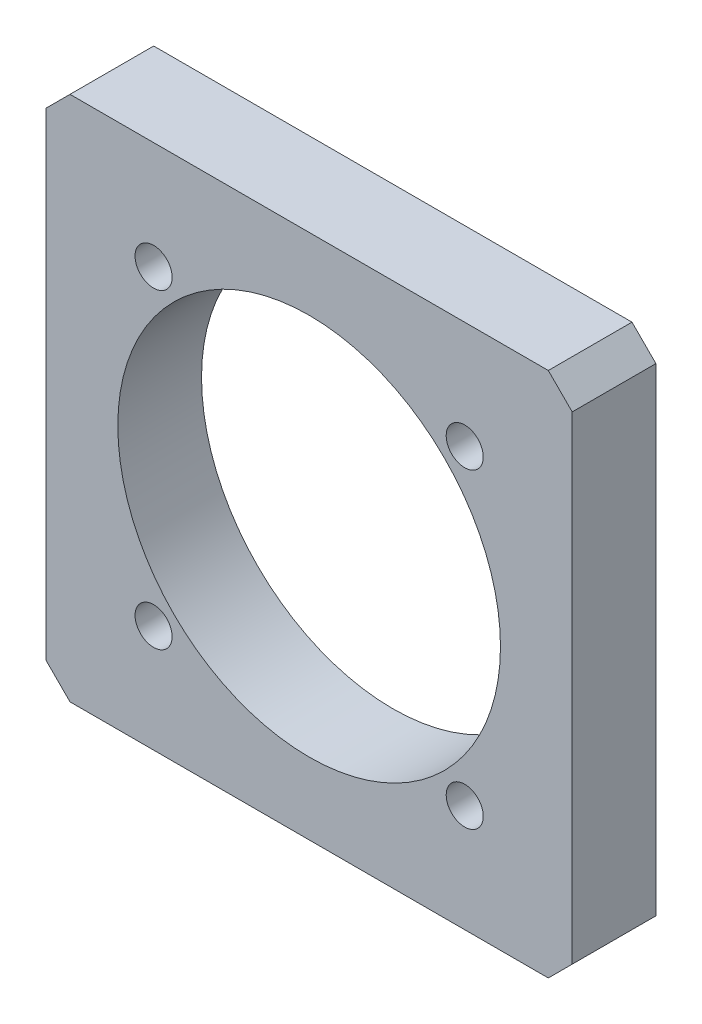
ISO-10303-21;
HEADER;
FILE_DESCRIPTION(('STEP AP214'),'2;1');
FILE_NAME('part.step','',(''),(''),'','','');
FILE_SCHEMA(('AUTOMOTIVE_DESIGN { 1 0 10303 214 1 1 1 1 }'));
ENDSEC;
DATA;
#1=APPLICATION_CONTEXT('core data for automotive mechanical design processes');
#2=APPLICATION_PROTOCOL_DEFINITION('international standard','automotive_design',2000,#1);
#3=PRODUCT_CONTEXT('',#1,'mechanical');
#4=PRODUCT('Part','Part','',(#3));
#5=PRODUCT_RELATED_PRODUCT_CATEGORY('part','',(#4));
#6=PRODUCT_DEFINITION_FORMATION('','',#4);
#7=PRODUCT_DEFINITION_CONTEXT('part definition',#1,'design');
#8=PRODUCT_DEFINITION('design','',#6,#7);
#9=PRODUCT_DEFINITION_SHAPE('','',#8);
#10=(LENGTH_UNIT() NAMED_UNIT(*) SI_UNIT(.MILLI.,.METRE.));
#11=(NAMED_UNIT(*) PLANE_ANGLE_UNIT() SI_UNIT($,.RADIAN.));
#12=(NAMED_UNIT(*) SI_UNIT($,.STERADIAN.) SOLID_ANGLE_UNIT());
#13=UNCERTAINTY_MEASURE_WITH_UNIT(LENGTH_MEASURE(1.E-05),#10,'distance_accuracy_value','');
#14=(GEOMETRIC_REPRESENTATION_CONTEXT(3) GLOBAL_UNCERTAINTY_ASSIGNED_CONTEXT((#13)) GLOBAL_UNIT_ASSIGNED_CONTEXT((#10,
#11,#12)) REPRESENTATION_CONTEXT('',''));
#15=CARTESIAN_POINT('',(0.,0.,0.));
#16=DIRECTION('',(0.,0.,1.));
#17=DIRECTION('',(1.,0.,0.));
#18=AXIS2_PLACEMENT_3D('',#15,#16,#17);
#19=CARTESIAN_POINT('',(-110.,-110.,35.));
#20=DIRECTION('',(0.,0.,1.));
#21=DIRECTION('',(1.,0.,0.));
#22=AXIS2_PLACEMENT_3D('',#19,#20,#21);
#23=PLANE('',#22);
#24=CARTESIAN_POINT('',(-65.0538238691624,65.0538238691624,35.));
#25=DIRECTION('',(0.,0.,-1.));
#26=DIRECTION('',(-1.,0.,0.));
#27=AXIS2_PLACEMENT_3D('',#24,#25,#26);
#28=CIRCLE('',#27,7.74999999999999);
#29=CARTESIAN_POINT('',(-72.8038238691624,65.0538238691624,35.));
#30=VERTEX_POINT('',#29);
#31=EDGE_CURVE('E203',#30,#30,#28,.T.);
#32=ORIENTED_EDGE('',*,*,#31,.T.);
#33=EDGE_LOOP('',(#32));
#34=FACE_BOUND('',#33,.T.);
#35=CARTESIAN_POINT('',(65.0538238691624,65.0538238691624,35.));
#36=DIRECTION('',(0.,0.,-1.));
#37=DIRECTION('',(-1.,0.,0.));
#38=AXIS2_PLACEMENT_3D('',#35,#36,#37);
#39=CIRCLE('',#38,7.74999999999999);
#40=CARTESIAN_POINT('',(57.3038238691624,65.0538238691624,35.));
#41=VERTEX_POINT('',#40);
#42=EDGE_CURVE('E197',#41,#41,#39,.T.);
#43=ORIENTED_EDGE('',*,*,#42,.T.);
#44=EDGE_LOOP('',(#43));
#45=FACE_BOUND('',#44,.T.);
#46=CARTESIAN_POINT('',(65.0538238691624,-65.0538238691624,35.));
#47=DIRECTION('',(0.,0.,-1.));
#48=DIRECTION('',(-1.,0.,0.));
#49=AXIS2_PLACEMENT_3D('',#46,#47,#48);
#50=CIRCLE('',#49,7.74999999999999);
#51=CARTESIAN_POINT('',(57.3038238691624,-65.0538238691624,35.));
#52=VERTEX_POINT('',#51);
#53=EDGE_CURVE('E191',#52,#52,#50,.T.);
#54=ORIENTED_EDGE('',*,*,#53,.T.);
#55=EDGE_LOOP('',(#54));
#56=FACE_BOUND('',#55,.T.);
#57=CARTESIAN_POINT('',(-65.0538238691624,-65.0538238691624,35.));
#58=DIRECTION('',(0.,0.,-1.));
#59=DIRECTION('',(-1.,0.,0.));
#60=AXIS2_PLACEMENT_3D('',#57,#58,#59);
#61=CIRCLE('',#60,7.74999999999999);
#62=CARTESIAN_POINT('',(-72.8038238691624,-65.0538238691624,35.));
#63=VERTEX_POINT('',#62);
#64=EDGE_CURVE('E183',#63,#63,#61,.T.);
#65=ORIENTED_EDGE('',*,*,#64,.T.);
#66=EDGE_LOOP('',(#65));
#67=FACE_BOUND('',#66,.T.);
#68=DIRECTION('',(0.,-1.,0.));
#69=VECTOR('',#68,1.);
#70=CARTESIAN_POINT('',(-110.,110.,35.));
#71=LINE('',#70,#69);
#72=CARTESIAN_POINT('',(-110.,99.9999999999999,35.));
#73=VERTEX_POINT('',#72);
#74=CARTESIAN_POINT('',(-110.,-99.9999999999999,35.));
#75=VERTEX_POINT('',#74);
#76=EDGE_CURVE('E137',#73,#75,#71,.T.);
#77=ORIENTED_EDGE('',*,*,#76,.T.);
#78=DIRECTION('',(-0.707106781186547,0.707106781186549,0.));
#79=VECTOR('',#78,1.);
#80=CARTESIAN_POINT('',(-105.,-105.,35.));
#81=LINE('',#80,#79);
#82=CARTESIAN_POINT('',(-99.9999999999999,-110.,35.));
#83=VERTEX_POINT('',#82);
#84=EDGE_CURVE('E151',#75,#83,#81,.F.);
#85=ORIENTED_EDGE('',*,*,#84,.T.);
#86=DIRECTION('',(1.,0.,0.));
#87=VECTOR('',#86,1.);
#88=CARTESIAN_POINT('',(-110.,-110.,35.));
#89=LINE('',#88,#87);
#90=CARTESIAN_POINT('',(100.,-110.,35.));
#91=VERTEX_POINT('',#90);
#92=EDGE_CURVE('E118',#83,#91,#89,.T.);
#93=ORIENTED_EDGE('',*,*,#92,.T.);
#94=DIRECTION('',(-0.707106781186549,-0.707106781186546,0.));
#95=VECTOR('',#94,1.);
#96=CARTESIAN_POINT('',(-5.00000000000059,-215.,35.));
#97=LINE('',#96,#95);
#98=CARTESIAN_POINT('',(110.,-100.,35.));
#99=VERTEX_POINT('',#98);
#100=EDGE_CURVE('E147',#91,#99,#97,.F.);
#101=ORIENTED_EDGE('',*,*,#100,.T.);
#102=DIRECTION('',(0.,1.,0.));
#103=VECTOR('',#102,1.);
#104=CARTESIAN_POINT('',(110.,110.,35.));
#105=LINE('',#104,#103);
#106=CARTESIAN_POINT('',(110.,100.,35.));
#107=VERTEX_POINT('',#106);
#108=EDGE_CURVE('E160',#99,#107,#105,.T.);
#109=ORIENTED_EDGE('',*,*,#108,.T.);
#110=DIRECTION('',(0.707106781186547,-0.707106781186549,0.));
#111=VECTOR('',#110,1.);
#112=CARTESIAN_POINT('',(105.,105.,35.));
#113=LINE('',#112,#111);
#114=CARTESIAN_POINT('',(99.9999999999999,110.,35.));
#115=VERTEX_POINT('',#114);
#116=EDGE_CURVE('E53',#107,#115,#113,.F.);
#117=ORIENTED_EDGE('',*,*,#116,.T.);
#118=DIRECTION('',(-1.,0.,0.));
#119=VECTOR('',#118,1.);
#120=CARTESIAN_POINT('',(-110.,110.,35.));
#121=LINE('',#120,#119);
#122=CARTESIAN_POINT('',(-99.9999999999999,110.,35.));
#123=VERTEX_POINT('',#122);
#124=EDGE_CURVE('E138',#115,#123,#121,.T.);
#125=ORIENTED_EDGE('',*,*,#124,.T.);
#126=DIRECTION('',(0.707106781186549,0.707106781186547,0.));
#127=VECTOR('',#126,1.);
#128=CARTESIAN_POINT('',(-215.,-4.99999999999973,35.));
#129=LINE('',#128,#127);
#130=EDGE_CURVE('E149',#123,#73,#129,.F.);
#131=ORIENTED_EDGE('',*,*,#130,.T.);
#132=EDGE_LOOP('',(#77,#85,#93,#101,#109,#117,#125,#131));
#133=FACE_BOUND('',#132,.T.);
#134=CARTESIAN_POINT('',(0.,0.,35.));
#135=DIRECTION('',(0.,0.,1.));
#136=DIRECTION('',(1.,0.,0.));
#137=AXIS2_PLACEMENT_3D('',#134,#135,#136);
#138=CIRCLE('',#137,80.);
#139=CARTESIAN_POINT('',(80.,0.,35.));
#140=VERTEX_POINT('',#139);
#141=EDGE_CURVE('E132',#140,#140,#138,.T.);
#142=ORIENTED_EDGE('',*,*,#141,.F.);
#143=EDGE_LOOP('',(#142));
#144=FACE_BOUND('',#143,.T.);
#145=ADVANCED_FACE('F31',(#34,#45,#56,#67,#133,#144),#23,.T.);
#146=CARTESIAN_POINT('',(-110.,-110.,0.));
#147=DIRECTION('',(0.,0.,1.));
#148=DIRECTION('',(1.,0.,0.));
#149=AXIS2_PLACEMENT_3D('',#146,#147,#148);
#150=PLANE('',#149);
#151=CARTESIAN_POINT('',(-65.0538238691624,65.0538238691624,0.));
#152=DIRECTION('',(0.,0.,-1.));
#153=DIRECTION('',(-1.,0.,0.));
#154=AXIS2_PLACEMENT_3D('',#151,#152,#153);
#155=CIRCLE('',#154,7.74999999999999);
#156=CARTESIAN_POINT('',(-72.8038238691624,65.0538238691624,0.));
#157=VERTEX_POINT('',#156);
#158=EDGE_CURVE('E206',#157,#157,#155,.T.);
#159=ORIENTED_EDGE('',*,*,#158,.F.);
#160=EDGE_LOOP('',(#159));
#161=FACE_BOUND('',#160,.T.);
#162=CARTESIAN_POINT('',(65.0538238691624,65.0538238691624,0.));
#163=DIRECTION('',(0.,0.,-1.));
#164=DIRECTION('',(-1.,0.,0.));
#165=AXIS2_PLACEMENT_3D('',#162,#163,#164);
#166=CIRCLE('',#165,7.74999999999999);
#167=CARTESIAN_POINT('',(57.3038238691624,65.0538238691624,0.));
#168=VERTEX_POINT('',#167);
#169=EDGE_CURVE('E200',#168,#168,#166,.T.);
#170=ORIENTED_EDGE('',*,*,#169,.F.);
#171=EDGE_LOOP('',(#170));
#172=FACE_BOUND('',#171,.T.);
#173=CARTESIAN_POINT('',(65.0538238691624,-65.0538238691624,0.));
#174=DIRECTION('',(0.,0.,-1.));
#175=DIRECTION('',(-1.,0.,0.));
#176=AXIS2_PLACEMENT_3D('',#173,#174,#175);
#177=CIRCLE('',#176,7.74999999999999);
#178=CARTESIAN_POINT('',(57.3038238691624,-65.0538238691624,0.));
#179=VERTEX_POINT('',#178);
#180=EDGE_CURVE('E194',#179,#179,#177,.T.);
#181=ORIENTED_EDGE('',*,*,#180,.F.);
#182=EDGE_LOOP('',(#181));
#183=FACE_BOUND('',#182,.T.);
#184=CARTESIAN_POINT('',(-65.0538238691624,-65.0538238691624,0.));
#185=DIRECTION('',(0.,0.,-1.));
#186=DIRECTION('',(-1.,0.,0.));
#187=AXIS2_PLACEMENT_3D('',#184,#185,#186);
#188=CIRCLE('',#187,7.74999999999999);
#189=CARTESIAN_POINT('',(-72.8038238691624,-65.0538238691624,0.));
#190=VERTEX_POINT('',#189);
#191=EDGE_CURVE('E188',#190,#190,#188,.T.);
#192=ORIENTED_EDGE('',*,*,#191,.F.);
#193=EDGE_LOOP('',(#192));
#194=FACE_BOUND('',#193,.T.);
#195=DIRECTION('',(1.,0.,0.));
#196=VECTOR('',#195,1.);
#197=CARTESIAN_POINT('',(-110.,-110.,0.));
#198=LINE('',#197,#196);
#199=CARTESIAN_POINT('',(-99.9999999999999,-110.,0.));
#200=VERTEX_POINT('',#199);
#201=CARTESIAN_POINT('',(99.9999999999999,-110.,0.));
#202=VERTEX_POINT('',#201);
#203=EDGE_CURVE('E115',#200,#202,#198,.T.);
#204=ORIENTED_EDGE('',*,*,#203,.F.);
#205=DIRECTION('',(0.707106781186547,-0.707106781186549,0.));
#206=VECTOR('',#205,1.);
#207=CARTESIAN_POINT('',(-99.9999999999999,-110.,0.));
#208=LINE('',#207,#206);
#209=CARTESIAN_POINT('',(-110.,-99.9999999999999,0.));
#210=VERTEX_POINT('',#209);
#211=EDGE_CURVE('E98',#200,#210,#208,.F.);
#212=ORIENTED_EDGE('',*,*,#211,.T.);
#213=DIRECTION('',(0.,-1.,0.));
#214=VECTOR('',#213,1.);
#215=CARTESIAN_POINT('',(-110.,110.,0.));
#216=LINE('',#215,#214);
#217=CARTESIAN_POINT('',(-110.,100.,0.));
#218=VERTEX_POINT('',#217);
#219=EDGE_CURVE('E127',#218,#210,#216,.T.);
#220=ORIENTED_EDGE('',*,*,#219,.F.);
#221=DIRECTION('',(-0.707106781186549,-0.707106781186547,0.));
#222=VECTOR('',#221,1.);
#223=CARTESIAN_POINT('',(-110.,100.,0.));
#224=LINE('',#223,#222);
#225=CARTESIAN_POINT('',(-99.9999999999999,110.,0.));
#226=VERTEX_POINT('',#225);
#227=EDGE_CURVE('E109',#218,#226,#224,.F.);
#228=ORIENTED_EDGE('',*,*,#227,.T.);
#229=DIRECTION('',(-1.,0.,0.));
#230=VECTOR('',#229,1.);
#231=CARTESIAN_POINT('',(-110.,110.,0.));
#232=LINE('',#231,#230);
#233=CARTESIAN_POINT('',(100.,110.,0.));
#234=VERTEX_POINT('',#233);
#235=EDGE_CURVE('E130',#234,#226,#232,.T.);
#236=ORIENTED_EDGE('',*,*,#235,.F.);
#237=DIRECTION('',(-0.707106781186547,0.707106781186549,0.));
#238=VECTOR('',#237,1.);
#239=CARTESIAN_POINT('',(100.,110.,0.));
#240=LINE('',#239,#238);
#241=CARTESIAN_POINT('',(110.,100.,0.));
#242=VERTEX_POINT('',#241);
#243=EDGE_CURVE('E119',#234,#242,#240,.F.);
#244=ORIENTED_EDGE('',*,*,#243,.T.);
#245=DIRECTION('',(0.,1.,0.));
#246=VECTOR('',#245,1.);
#247=CARTESIAN_POINT('',(110.,110.,0.));
#248=LINE('',#247,#246);
#249=CARTESIAN_POINT('',(110.,-100.,0.));
#250=VERTEX_POINT('',#249);
#251=EDGE_CURVE('E126',#250,#242,#248,.T.);
#252=ORIENTED_EDGE('',*,*,#251,.F.);
#253=DIRECTION('',(0.707106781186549,0.707106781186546,0.));
#254=VECTOR('',#253,1.);
#255=CARTESIAN_POINT('',(110.,-100.,0.));
#256=LINE('',#255,#254);
#257=EDGE_CURVE('E125',#250,#202,#256,.F.);
#258=ORIENTED_EDGE('',*,*,#257,.T.);
#259=EDGE_LOOP('',(#204,#212,#220,#228,#236,#244,#252,#258));
#260=FACE_BOUND('',#259,.T.);
#261=CARTESIAN_POINT('',(0.,0.,0.));
#262=DIRECTION('',(0.,0.,1.));
#263=DIRECTION('',(1.,0.,0.));
#264=AXIS2_PLACEMENT_3D('',#261,#262,#263);
#265=CIRCLE('',#264,80.);
#266=CARTESIAN_POINT('',(80.,0.,0.));
#267=VERTEX_POINT('',#266);
#268=EDGE_CURVE('E180',#267,#267,#265,.T.);
#269=ORIENTED_EDGE('',*,*,#268,.T.);
#270=EDGE_LOOP('',(#269));
#271=FACE_BOUND('',#270,.T.);
#272=ADVANCED_FACE('F122',(#161,#172,#183,#194,#260,#271),#150,.F.);
#273=CARTESIAN_POINT('',(-110.,110.,35.));
#274=DIRECTION('',(1.,0.,0.));
#275=DIRECTION('',(0.,1.,0.));
#276=AXIS2_PLACEMENT_3D('',#273,#274,#275);
#277=PLANE('',#276);
#278=ORIENTED_EDGE('',*,*,#219,.T.);
#279=DIRECTION('',(0.,0.,1.));
#280=VECTOR('',#279,1.);
#281=CARTESIAN_POINT('',(-110.,-99.9999999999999,35.));
#282=LINE('',#281,#280);
#283=EDGE_CURVE('E103',#210,#75,#282,.T.);
#284=ORIENTED_EDGE('',*,*,#283,.T.);
#285=ORIENTED_EDGE('',*,*,#76,.F.);
#286=DIRECTION('',(0.,0.,-1.));
#287=VECTOR('',#286,1.);
#288=CARTESIAN_POINT('',(-110.,100.,35.));
#289=LINE('',#288,#287);
#290=EDGE_CURVE('E108',#73,#218,#289,.T.);
#291=ORIENTED_EDGE('',*,*,#290,.T.);
#292=EDGE_LOOP('',(#278,#284,#285,#291));
#293=FACE_BOUND('',#292,.T.);
#294=ADVANCED_FACE('F176',(#293),#277,.F.);
#295=CARTESIAN_POINT('',(-110.,-110.,35.));
#296=DIRECTION('',(0.,1.,0.));
#297=DIRECTION('',(0.,0.,1.));
#298=AXIS2_PLACEMENT_3D('',#295,#296,#297);
#299=PLANE('',#298);
#300=ORIENTED_EDGE('',*,*,#92,.F.);
#301=DIRECTION('',(0.,0.,-1.));
#302=VECTOR('',#301,1.);
#303=CARTESIAN_POINT('',(-99.9999999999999,-110.,35.));
#304=LINE('',#303,#302);
#305=EDGE_CURVE('E102',#83,#200,#304,.T.);
#306=ORIENTED_EDGE('',*,*,#305,.T.);
#307=ORIENTED_EDGE('',*,*,#203,.T.);
#308=DIRECTION('',(0.,0.,1.));
#309=VECTOR('',#308,1.);
#310=CARTESIAN_POINT('',(99.9999999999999,-110.,35.));
#311=LINE('',#310,#309);
#312=EDGE_CURVE('E120',#202,#91,#311,.T.);
#313=ORIENTED_EDGE('',*,*,#312,.T.);
#314=EDGE_LOOP('',(#300,#306,#307,#313));
#315=FACE_BOUND('',#314,.T.);
#316=ADVANCED_FACE('F114',(#315),#299,.F.);
#317=CARTESIAN_POINT('',(110.,110.,35.));
#318=DIRECTION('',(-1.,0.,0.));
#319=DIRECTION('',(0.,-1.,0.));
#320=AXIS2_PLACEMENT_3D('',#317,#318,#319);
#321=PLANE('',#320);
#322=ORIENTED_EDGE('',*,*,#108,.F.);
#323=DIRECTION('',(0.,0.,-1.));
#324=VECTOR('',#323,1.);
#325=CARTESIAN_POINT('',(110.,-100.,35.));
#326=LINE('',#325,#324);
#327=EDGE_CURVE('E11',#99,#250,#326,.T.);
#328=ORIENTED_EDGE('',*,*,#327,.T.);
#329=ORIENTED_EDGE('',*,*,#251,.T.);
#330=DIRECTION('',(0.,0.,1.));
#331=VECTOR('',#330,1.);
#332=CARTESIAN_POINT('',(110.,100.,35.));
#333=LINE('',#332,#331);
#334=EDGE_CURVE('E39',#242,#107,#333,.T.);
#335=ORIENTED_EDGE('',*,*,#334,.T.);
#336=EDGE_LOOP('',(#322,#328,#329,#335));
#337=FACE_BOUND('',#336,.T.);
#338=ADVANCED_FACE('F159',(#337),#321,.F.);
#339=CARTESIAN_POINT('',(-110.,110.,35.));
#340=DIRECTION('',(0.,-1.,0.));
#341=DIRECTION('',(0.,0.,-1.));
#342=AXIS2_PLACEMENT_3D('',#339,#340,#341);
#343=PLANE('',#342);
#344=ORIENTED_EDGE('',*,*,#235,.T.);
#345=DIRECTION('',(0.,0.,1.));
#346=VECTOR('',#345,1.);
#347=CARTESIAN_POINT('',(-99.9999999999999,110.,35.));
#348=LINE('',#347,#346);
#349=EDGE_CURVE('E46',#226,#123,#348,.T.);
#350=ORIENTED_EDGE('',*,*,#349,.T.);
#351=ORIENTED_EDGE('',*,*,#124,.F.);
#352=DIRECTION('',(0.,0.,-1.));
#353=VECTOR('',#352,1.);
#354=CARTESIAN_POINT('',(100.,110.,35.));
#355=LINE('',#354,#353);
#356=EDGE_CURVE('E153',#115,#234,#355,.T.);
#357=ORIENTED_EDGE('',*,*,#356,.T.);
#358=EDGE_LOOP('',(#344,#350,#351,#357));
#359=FACE_BOUND('',#358,.T.);
#360=ADVANCED_FACE('F169',(#359),#343,.F.);
#361=CARTESIAN_POINT('',(0.,0.,35.));
#362=DIRECTION('',(0.,0.,-1.));
#363=DIRECTION('',(-1.,0.,0.));
#364=AXIS2_PLACEMENT_3D('',#361,#362,#363);
#365=CYLINDRICAL_SURFACE('',#364,80.);
#366=ORIENTED_EDGE('',*,*,#141,.T.);
#367=EDGE_LOOP('',(#366));
#368=FACE_BOUND('',#367,.T.);
#369=ORIENTED_EDGE('',*,*,#268,.F.);
#370=EDGE_LOOP('',(#369));
#371=FACE_BOUND('',#370,.T.);
#372=ADVANCED_FACE('F224',(#368,#371),#365,.F.);
#373=CARTESIAN_POINT('',(-65.0538238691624,-65.0538238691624,0.));
#374=DIRECTION('',(0.,0.,-1.));
#375=DIRECTION('',(-1.,0.,0.));
#376=AXIS2_PLACEMENT_3D('',#373,#374,#375);
#377=CYLINDRICAL_SURFACE('',#376,7.74999999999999);
#378=ORIENTED_EDGE('',*,*,#64,.F.);
#379=EDGE_LOOP('',(#378));
#380=FACE_BOUND('',#379,.T.);
#381=ORIENTED_EDGE('',*,*,#191,.T.);
#382=EDGE_LOOP('',(#381));
#383=FACE_BOUND('',#382,.T.);
#384=ADVANCED_FACE('F221',(#380,#383),#377,.F.);
#385=CARTESIAN_POINT('',(65.0538238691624,-65.0538238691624,0.));
#386=DIRECTION('',(0.,0.,-1.));
#387=DIRECTION('',(-1.,0.,0.));
#388=AXIS2_PLACEMENT_3D('',#385,#386,#387);
#389=CYLINDRICAL_SURFACE('',#388,7.74999999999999);
#390=ORIENTED_EDGE('',*,*,#53,.F.);
#391=EDGE_LOOP('',(#390));
#392=FACE_BOUND('',#391,.T.);
#393=ORIENTED_EDGE('',*,*,#180,.T.);
#394=EDGE_LOOP('',(#393));
#395=FACE_BOUND('',#394,.T.);
#396=ADVANCED_FACE('F223',(#392,#395),#389,.F.);
#397=CARTESIAN_POINT('',(65.0538238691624,65.0538238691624,0.));
#398=DIRECTION('',(0.,0.,-1.));
#399=DIRECTION('',(-1.,0.,0.));
#400=AXIS2_PLACEMENT_3D('',#397,#398,#399);
#401=CYLINDRICAL_SURFACE('',#400,7.74999999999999);
#402=ORIENTED_EDGE('',*,*,#42,.F.);
#403=EDGE_LOOP('',(#402));
#404=FACE_BOUND('',#403,.T.);
#405=ORIENTED_EDGE('',*,*,#169,.T.);
#406=EDGE_LOOP('',(#405));
#407=FACE_BOUND('',#406,.T.);
#408=ADVANCED_FACE('F231',(#404,#407),#401,.F.);
#409=CARTESIAN_POINT('',(-65.0538238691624,65.0538238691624,0.));
#410=DIRECTION('',(0.,0.,-1.));
#411=DIRECTION('',(-1.,0.,0.));
#412=AXIS2_PLACEMENT_3D('',#409,#410,#411);
#413=CYLINDRICAL_SURFACE('',#412,7.74999999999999);
#414=ORIENTED_EDGE('',*,*,#31,.F.);
#415=EDGE_LOOP('',(#414));
#416=FACE_BOUND('',#415,.T.);
#417=ORIENTED_EDGE('',*,*,#158,.T.);
#418=EDGE_LOOP('',(#417));
#419=FACE_BOUND('',#418,.T.);
#420=ADVANCED_FACE('F210',(#416,#419),#413,.F.);
#421=CARTESIAN_POINT('',(-99.9999999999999,-110.,35.));
#422=DIRECTION('',(0.707106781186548,0.707106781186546,0.));
#423=DIRECTION('',(-0.707106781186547,0.707106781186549,0.));
#424=AXIS2_PLACEMENT_3D('',#421,#422,#423);
#425=PLANE('',#424);
#426=ORIENTED_EDGE('',*,*,#84,.F.);
#427=ORIENTED_EDGE('',*,*,#283,.F.);
#428=ORIENTED_EDGE('',*,*,#211,.F.);
#429=ORIENTED_EDGE('',*,*,#305,.F.);
#430=EDGE_LOOP('',(#426,#427,#428,#429));
#431=FACE_BOUND('',#430,.T.);
#432=ADVANCED_FACE('F101',(#431),#425,.F.);
#433=CARTESIAN_POINT('',(-110.,100.,35.));
#434=DIRECTION('',(0.707106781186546,-0.707106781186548,0.));
#435=DIRECTION('',(0.707106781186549,0.707106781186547,0.));
#436=AXIS2_PLACEMENT_3D('',#433,#434,#435);
#437=PLANE('',#436);
#438=ORIENTED_EDGE('',*,*,#130,.F.);
#439=ORIENTED_EDGE('',*,*,#349,.F.);
#440=ORIENTED_EDGE('',*,*,#227,.F.);
#441=ORIENTED_EDGE('',*,*,#290,.F.);
#442=EDGE_LOOP('',(#438,#439,#440,#441));
#443=FACE_BOUND('',#442,.T.);
#444=ADVANCED_FACE('F173',(#443),#437,.F.);
#445=CARTESIAN_POINT('',(110.,-100.,35.));
#446=DIRECTION('',(-0.707106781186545,0.707106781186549,0.));
#447=DIRECTION('',(-0.707106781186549,-0.707106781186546,0.));
#448=AXIS2_PLACEMENT_3D('',#445,#446,#447);
#449=PLANE('',#448);
#450=ORIENTED_EDGE('',*,*,#100,.F.);
#451=ORIENTED_EDGE('',*,*,#312,.F.);
#452=ORIENTED_EDGE('',*,*,#257,.F.);
#453=ORIENTED_EDGE('',*,*,#327,.F.);
#454=EDGE_LOOP('',(#450,#451,#452,#453));
#455=FACE_BOUND('',#454,.T.);
#456=ADVANCED_FACE('F255',(#455),#449,.F.);
#457=CARTESIAN_POINT('',(100.,110.,35.));
#458=DIRECTION('',(-0.707106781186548,-0.707106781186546,0.));
#459=DIRECTION('',(0.707106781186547,-0.707106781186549,0.));
#460=AXIS2_PLACEMENT_3D('',#457,#458,#459);
#461=PLANE('',#460);
#462=ORIENTED_EDGE('',*,*,#116,.F.);
#463=ORIENTED_EDGE('',*,*,#334,.F.);
#464=ORIENTED_EDGE('',*,*,#243,.F.);
#465=ORIENTED_EDGE('',*,*,#356,.F.);
#466=EDGE_LOOP('',(#462,#463,#464,#465));
#467=FACE_BOUND('',#466,.T.);
#468=ADVANCED_FACE('F33',(#467),#461,.F.);
#469=CLOSED_SHELL('',(#145,#272,#294,#316,#338,#360,#372,#384,#396,#408,#420,#432,#444,#456,#468));
#470=MANIFOLD_SOLID_BREP('B2',#469);
#471=ADVANCED_BREP_SHAPE_REPRESENTATION('',(#18,#470),#14);
#472=SHAPE_DEFINITION_REPRESENTATION(#9,#471);
ENDSEC;
END-ISO-10303-21;
